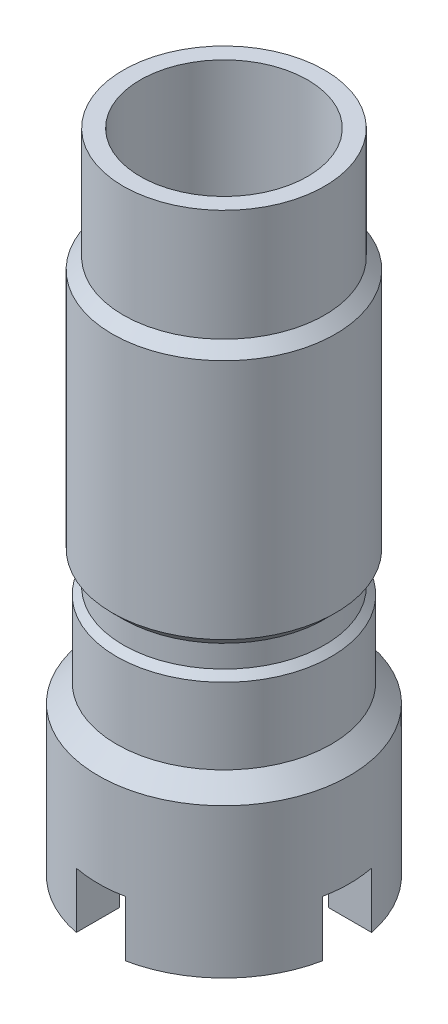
from build123d import *

# Parameters (mm, degrees)
EXTRUDE1_DEPTH = 3.175


with BuildPart() as part:
    # Sketch1 → Revolve1 (revolve)
    with BuildSketch(Plane.XY, mode=Mode.PRIVATE) as revolve1_sk:
        Polygon((-4.7625, 0), (-4.7625, 36.83), (-5.7277, 36.83), (-5.7277, 30.48), (-6.35, 29.8577), (-6.35, 16.1163), (-5.7277, 15.494), (-5.7277, 14.224), (-6.1087, 13.843), (-6.1087, 9.525), (-7.14375, 8.48995), (-7.14375, 0), align=None)
    revolve(revolve1_sk.sketch.rotate(Axis((0, 0, 0), (0, 1, 0)), 270), axis=Axis((0, 0, 0), (0, 1, 0)))

    # Sketch2 → Extrude1 (cut)
    with BuildSketch(Plane.XZ):
        Polygon((1.397, 1.397), (7.14375, 1.397), (7.14375, -1.397), (1.397, -1.397), (1.397, -7.14375), (-1.397, -7.14375), (-1.397, -1.397), (-7.14375, -1.397), (-7.14375, 1.397), (-1.397, 1.397), (-1.397, 7.14375), (1.397, 7.14375), align=None)
    extrude(amount=-EXTRUDE1_DEPTH, mode=Mode.SUBTRACT)


solid = part.part
